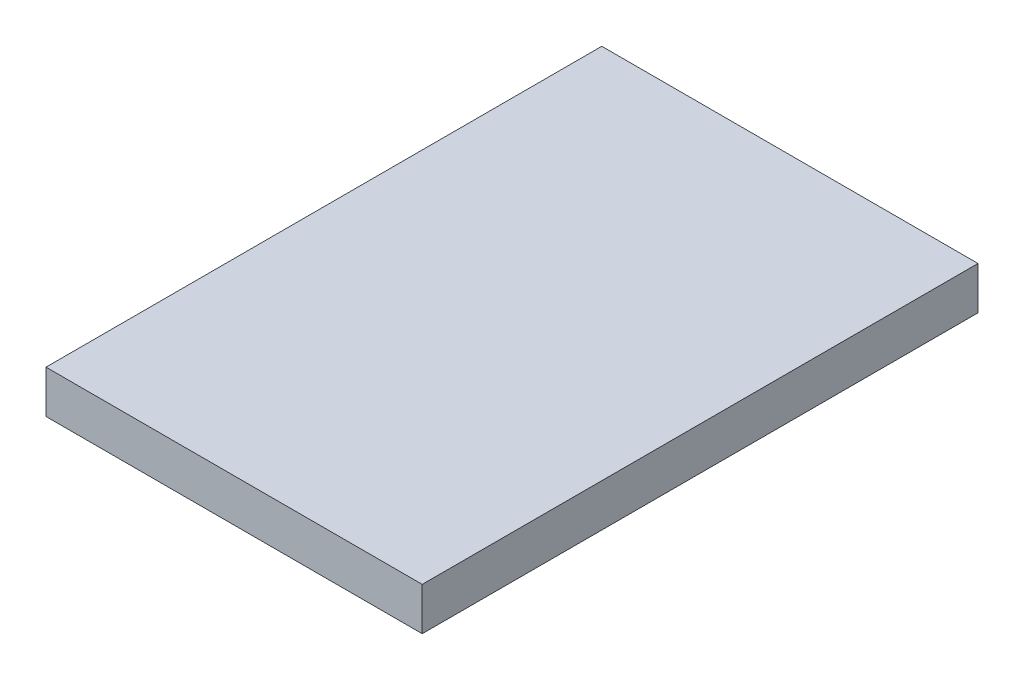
ISO-10303-21;
HEADER;
FILE_DESCRIPTION(('STEP AP214'),'2;1');
FILE_NAME('part.step','',(''),(''),'','','');
FILE_SCHEMA(('AUTOMOTIVE_DESIGN { 1 0 10303 214 1 1 1 1 }'));
ENDSEC;
DATA;
#1=APPLICATION_CONTEXT('core data for automotive mechanical design processes');
#2=APPLICATION_PROTOCOL_DEFINITION('international standard','automotive_design',2000,#1);
#3=PRODUCT_CONTEXT('',#1,'mechanical');
#4=PRODUCT('Part','Part','',(#3));
#5=PRODUCT_RELATED_PRODUCT_CATEGORY('part','',(#4));
#6=PRODUCT_DEFINITION_FORMATION('','',#4);
#7=PRODUCT_DEFINITION_CONTEXT('part definition',#1,'design');
#8=PRODUCT_DEFINITION('design','',#6,#7);
#9=PRODUCT_DEFINITION_SHAPE('','',#8);
#10=(LENGTH_UNIT() NAMED_UNIT(*) SI_UNIT(.MILLI.,.METRE.));
#11=(NAMED_UNIT(*) PLANE_ANGLE_UNIT() SI_UNIT($,.RADIAN.));
#12=(NAMED_UNIT(*) SI_UNIT($,.STERADIAN.) SOLID_ANGLE_UNIT());
#13=UNCERTAINTY_MEASURE_WITH_UNIT(LENGTH_MEASURE(1.E-05),#10,'distance_accuracy_value','');
#14=(GEOMETRIC_REPRESENTATION_CONTEXT(3) GLOBAL_UNCERTAINTY_ASSIGNED_CONTEXT((#13)) GLOBAL_UNIT_ASSIGNED_CONTEXT((#10,
#11,#12)) REPRESENTATION_CONTEXT('',''));
#15=CARTESIAN_POINT('',(0.,0.,0.));
#16=DIRECTION('',(0.,0.,1.));
#17=DIRECTION('',(1.,0.,0.));
#18=AXIS2_PLACEMENT_3D('',#15,#16,#17);
#19=CARTESIAN_POINT('',(-44.,10.,130.));
#20=DIRECTION('',(1.,0.,0.));
#21=DIRECTION('',(0.,0.,-1.));
#22=AXIS2_PLACEMENT_3D('',#19,#20,#21);
#23=PLANE('',#22);
#24=DIRECTION('',(0.,-1.,0.));
#25=VECTOR('',#24,1.);
#26=CARTESIAN_POINT('',(-44.,10.,0.));
#27=LINE('',#26,#25);
#28=CARTESIAN_POINT('',(-44.,10.,0.));
#29=VERTEX_POINT('',#28);
#30=CARTESIAN_POINT('',(-44.,0.,0.));
#31=VERTEX_POINT('',#30);
#32=EDGE_CURVE('E77',#29,#31,#27,.T.);
#33=ORIENTED_EDGE('',*,*,#32,.T.);
#34=DIRECTION('',(0.,0.,-1.));
#35=VECTOR('',#34,1.);
#36=CARTESIAN_POINT('',(-44.,0.,130.));
#37=LINE('',#36,#35);
#38=CARTESIAN_POINT('',(-44.,0.,130.));
#39=VERTEX_POINT('',#38);
#40=EDGE_CURVE('E11',#39,#31,#37,.T.);
#41=ORIENTED_EDGE('',*,*,#40,.F.);
#42=DIRECTION('',(0.,-1.,0.));
#43=VECTOR('',#42,1.);
#44=CARTESIAN_POINT('',(-44.,10.,130.));
#45=LINE('',#44,#43);
#46=CARTESIAN_POINT('',(-44.,10.,130.));
#47=VERTEX_POINT('',#46);
#48=EDGE_CURVE('E95',#47,#39,#45,.T.);
#49=ORIENTED_EDGE('',*,*,#48,.F.);
#50=DIRECTION('',(0.,0.,-1.));
#51=VECTOR('',#50,1.);
#52=CARTESIAN_POINT('',(-44.,10.,130.));
#53=LINE('',#52,#51);
#54=EDGE_CURVE('E89',#47,#29,#53,.T.);
#55=ORIENTED_EDGE('',*,*,#54,.T.);
#56=EDGE_LOOP('',(#33,#41,#49,#55));
#57=FACE_BOUND('',#56,.T.);
#58=ADVANCED_FACE('F33',(#57),#23,.F.);
#59=CARTESIAN_POINT('',(-44.,0.,130.));
#60=DIRECTION('',(0.,1.,0.));
#61=DIRECTION('',(0.,0.,1.));
#62=AXIS2_PLACEMENT_3D('',#59,#60,#61);
#63=PLANE('',#62);
#64=DIRECTION('',(1.,0.,0.));
#65=VECTOR('',#64,1.);
#66=CARTESIAN_POINT('',(-44.,0.,0.));
#67=LINE('',#66,#65);
#68=CARTESIAN_POINT('',(44.,0.,0.));
#69=VERTEX_POINT('',#68);
#70=EDGE_CURVE('E73',#31,#69,#67,.T.);
#71=ORIENTED_EDGE('',*,*,#70,.T.);
#72=DIRECTION('',(0.,0.,-1.));
#73=VECTOR('',#72,1.);
#74=CARTESIAN_POINT('',(44.,0.,130.));
#75=LINE('',#74,#73);
#76=CARTESIAN_POINT('',(44.,0.,130.));
#77=VERTEX_POINT('',#76);
#78=EDGE_CURVE('E40',#77,#69,#75,.T.);
#79=ORIENTED_EDGE('',*,*,#78,.F.);
#80=DIRECTION('',(1.,0.,0.));
#81=VECTOR('',#80,1.);
#82=CARTESIAN_POINT('',(-44.,0.,130.));
#83=LINE('',#82,#81);
#84=EDGE_CURVE('E85',#39,#77,#83,.T.);
#85=ORIENTED_EDGE('',*,*,#84,.F.);
#86=ORIENTED_EDGE('',*,*,#40,.T.);
#87=EDGE_LOOP('',(#71,#79,#85,#86));
#88=FACE_BOUND('',#87,.T.);
#89=ADVANCED_FACE('F84',(#88),#63,.F.);
#90=CARTESIAN_POINT('',(44.,10.,130.));
#91=DIRECTION('',(-1.,0.,0.));
#92=DIRECTION('',(0.,0.,1.));
#93=AXIS2_PLACEMENT_3D('',#90,#91,#92);
#94=PLANE('',#93);
#95=DIRECTION('',(0.,1.,0.));
#96=VECTOR('',#95,1.);
#97=CARTESIAN_POINT('',(44.,10.,0.));
#98=LINE('',#97,#96);
#99=CARTESIAN_POINT('',(44.,10.,0.));
#100=VERTEX_POINT('',#99);
#101=EDGE_CURVE('E78',#69,#100,#98,.T.);
#102=ORIENTED_EDGE('',*,*,#101,.T.);
#103=DIRECTION('',(0.,0.,-1.));
#104=VECTOR('',#103,1.);
#105=CARTESIAN_POINT('',(44.,10.,130.));
#106=LINE('',#105,#104);
#107=CARTESIAN_POINT('',(44.,10.,130.));
#108=VERTEX_POINT('',#107);
#109=EDGE_CURVE('E101',#108,#100,#106,.T.);
#110=ORIENTED_EDGE('',*,*,#109,.F.);
#111=DIRECTION('',(0.,1.,0.));
#112=VECTOR('',#111,1.);
#113=CARTESIAN_POINT('',(44.,10.,130.));
#114=LINE('',#113,#112);
#115=EDGE_CURVE('E52',#77,#108,#114,.T.);
#116=ORIENTED_EDGE('',*,*,#115,.F.);
#117=ORIENTED_EDGE('',*,*,#78,.T.);
#118=EDGE_LOOP('',(#102,#110,#116,#117));
#119=FACE_BOUND('',#118,.T.);
#120=ADVANCED_FACE('F104',(#119),#94,.F.);
#121=CARTESIAN_POINT('',(-44.,10.,130.));
#122=DIRECTION('',(0.,-1.,0.));
#123=DIRECTION('',(0.,0.,-1.));
#124=AXIS2_PLACEMENT_3D('',#121,#122,#123);
#125=PLANE('',#124);
#126=DIRECTION('',(-1.,0.,0.));
#127=VECTOR('',#126,1.);
#128=CARTESIAN_POINT('',(-44.,10.,0.));
#129=LINE('',#128,#127);
#130=EDGE_CURVE('E93',#100,#29,#129,.T.);
#131=ORIENTED_EDGE('',*,*,#130,.T.);
#132=ORIENTED_EDGE('',*,*,#54,.F.);
#133=DIRECTION('',(-1.,0.,0.));
#134=VECTOR('',#133,1.);
#135=CARTESIAN_POINT('',(-44.,10.,130.));
#136=LINE('',#135,#134);
#137=EDGE_CURVE('E47',#108,#47,#136,.T.);
#138=ORIENTED_EDGE('',*,*,#137,.F.);
#139=ORIENTED_EDGE('',*,*,#109,.T.);
#140=EDGE_LOOP('',(#131,#132,#138,#139));
#141=FACE_BOUND('',#140,.T.);
#142=ADVANCED_FACE('F106',(#141),#125,.F.);
#143=CARTESIAN_POINT('',(-44.,0.,130.));
#144=DIRECTION('',(0.,0.,1.));
#145=DIRECTION('',(1.,0.,0.));
#146=AXIS2_PLACEMENT_3D('',#143,#144,#145);
#147=PLANE('',#146);
#148=ORIENTED_EDGE('',*,*,#48,.T.);
#149=ORIENTED_EDGE('',*,*,#84,.T.);
#150=ORIENTED_EDGE('',*,*,#115,.T.);
#151=ORIENTED_EDGE('',*,*,#137,.T.);
#152=EDGE_LOOP('',(#148,#149,#150,#151));
#153=FACE_BOUND('',#152,.T.);
#154=ADVANCED_FACE('F107',(#153),#147,.T.);
#155=CARTESIAN_POINT('',(-44.,0.,0.));
#156=DIRECTION('',(0.,0.,1.));
#157=DIRECTION('',(1.,0.,0.));
#158=AXIS2_PLACEMENT_3D('',#155,#156,#157);
#159=PLANE('',#158);
#160=ORIENTED_EDGE('',*,*,#32,.F.);
#161=ORIENTED_EDGE('',*,*,#130,.F.);
#162=ORIENTED_EDGE('',*,*,#101,.F.);
#163=ORIENTED_EDGE('',*,*,#70,.F.);
#164=EDGE_LOOP('',(#160,#161,#162,#163));
#165=FACE_BOUND('',#164,.T.);
#166=ADVANCED_FACE('F74',(#165),#159,.F.);
#167=CLOSED_SHELL('',(#58,#89,#120,#142,#154,#166));
#168=MANIFOLD_SOLID_BREP('B2',#167);
#169=ADVANCED_BREP_SHAPE_REPRESENTATION('',(#18,#168),#14);
#170=SHAPE_DEFINITION_REPRESENTATION(#9,#169);
ENDSEC;
END-ISO-10303-21;
